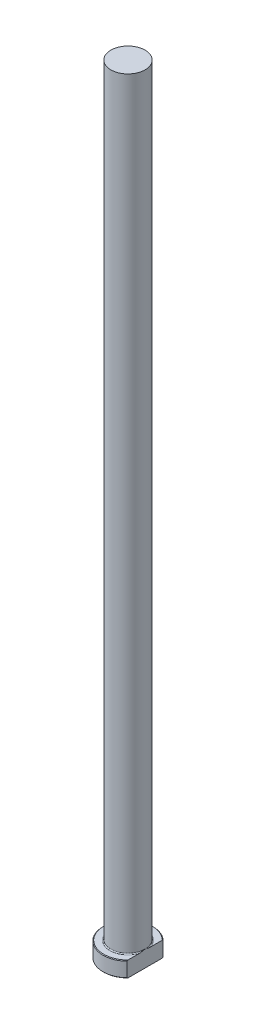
ISO-10303-21;
HEADER;
FILE_DESCRIPTION(('STEP AP214'),'2;1');
FILE_NAME('part.step','',(''),(''),'','','');
FILE_SCHEMA(('AUTOMOTIVE_DESIGN { 1 0 10303 214 1 1 1 1 }'));
ENDSEC;
DATA;
#1=APPLICATION_CONTEXT('core data for automotive mechanical design processes');
#2=APPLICATION_PROTOCOL_DEFINITION('international standard','automotive_design',2000,#1);
#3=PRODUCT_CONTEXT('',#1,'mechanical');
#4=PRODUCT('Part','Part','',(#3));
#5=PRODUCT_RELATED_PRODUCT_CATEGORY('part','',(#4));
#6=PRODUCT_DEFINITION_FORMATION('','',#4);
#7=PRODUCT_DEFINITION_CONTEXT('part definition',#1,'design');
#8=PRODUCT_DEFINITION('design','',#6,#7);
#9=PRODUCT_DEFINITION_SHAPE('','',#8);
#10=(LENGTH_UNIT() NAMED_UNIT(*) SI_UNIT(.MILLI.,.METRE.));
#11=(NAMED_UNIT(*) PLANE_ANGLE_UNIT() SI_UNIT($,.RADIAN.));
#12=(NAMED_UNIT(*) SI_UNIT($,.STERADIAN.) SOLID_ANGLE_UNIT());
#13=UNCERTAINTY_MEASURE_WITH_UNIT(LENGTH_MEASURE(1.E-05),#10,'distance_accuracy_value','');
#14=(GEOMETRIC_REPRESENTATION_CONTEXT(3) GLOBAL_UNCERTAINTY_ASSIGNED_CONTEXT((#13)) GLOBAL_UNIT_ASSIGNED_CONTEXT((#10,
#11,#12)) REPRESENTATION_CONTEXT('',''));
#15=CARTESIAN_POINT('',(0.,0.,0.));
#16=DIRECTION('',(0.,0.,1.));
#17=DIRECTION('',(1.,0.,0.));
#18=AXIS2_PLACEMENT_3D('',#15,#16,#17);
#19=CARTESIAN_POINT('',(0.,0.,0.));
#20=DIRECTION('',(0.,-1.,0.));
#21=DIRECTION('',(0.,0.,-1.));
#22=AXIS2_PLACEMENT_3D('',#19,#20,#21);
#23=PLANE('',#22);
#24=CARTESIAN_POINT('',(0.,0.,0.));
#25=DIRECTION('',(0.,-1.,0.));
#26=DIRECTION('',(0.,0.,-1.));
#27=AXIS2_PLACEMENT_3D('',#24,#25,#26);
#28=CIRCLE('',#27,7.79999999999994);
#29=CARTESIAN_POINT('',(5.49999999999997,0.,5.53082272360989));
#30=VERTEX_POINT('',#29);
#31=CARTESIAN_POINT('',(5.49999999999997,0.,-5.53082272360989));
#32=VERTEX_POINT('',#31);
#33=EDGE_CURVE('E98',#30,#32,#28,.T.);
#34=ORIENTED_EDGE('',*,*,#33,.T.);
#35=DIRECTION('',(0.,0.,1.));
#36=VECTOR('',#35,1.);
#37=CARTESIAN_POINT('',(5.49999999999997,0.,-5.80947501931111));
#38=LINE('',#37,#36);
#39=EDGE_CURVE('E83',#32,#30,#38,.T.);
#40=ORIENTED_EDGE('',*,*,#39,.T.);
#41=EDGE_LOOP('',(#34,#40));
#42=FACE_BOUND('',#41,.T.);
#43=ADVANCED_FACE('F32',(#42),#23,.T.);
#44=CARTESIAN_POINT('',(0.,259.958771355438,0.));
#45=DIRECTION('',(0.,1.,0.));
#46=DIRECTION('',(0.,0.,1.));
#47=AXIS2_PLACEMENT_3D('',#44,#45,#46);
#48=CYLINDRICAL_SURFACE('',#47,7.99999999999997);
#49=CARTESIAN_POINT('',(0.,4.80000000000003,0.));
#50=DIRECTION('',(0.,1.,0.));
#51=DIRECTION('',(0.,0.,1.));
#52=AXIS2_PLACEMENT_3D('',#49,#50,#51);
#53=CIRCLE('',#52,7.99999999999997);
#54=CARTESIAN_POINT('',(5.49999999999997,4.80000000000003,5.80947501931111));
#55=VERTEX_POINT('',#54);
#56=CARTESIAN_POINT('',(5.49999999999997,4.80000000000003,-5.80947501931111));
#57=VERTEX_POINT('',#56);
#58=EDGE_CURVE('E104',#55,#57,#53,.F.);
#59=ORIENTED_EDGE('',*,*,#58,.T.);
#60=DIRECTION('',(0.,-1.,0.));
#61=VECTOR('',#60,1.);
#62=CARTESIAN_POINT('',(5.49999999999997,250.,-5.80947501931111));
#63=LINE('',#62,#61);
#64=CARTESIAN_POINT('',(5.49999999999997,0.200000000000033,-5.80947501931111));
#65=VERTEX_POINT('',#64);
#66=EDGE_CURVE('E183',#57,#65,#63,.T.);
#67=ORIENTED_EDGE('',*,*,#66,.T.);
#68=CARTESIAN_POINT('',(0.,0.200000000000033,0.));
#69=DIRECTION('',(0.,-1.,0.));
#70=DIRECTION('',(0.,0.,-1.));
#71=AXIS2_PLACEMENT_3D('',#68,#69,#70);
#72=CIRCLE('',#71,7.99999999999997);
#73=CARTESIAN_POINT('',(5.49999999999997,0.200000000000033,5.80947501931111));
#74=VERTEX_POINT('',#73);
#75=EDGE_CURVE('E100',#65,#74,#72,.F.);
#76=ORIENTED_EDGE('',*,*,#75,.T.);
#77=DIRECTION('',(0.,-1.,0.));
#78=VECTOR('',#77,1.);
#79=CARTESIAN_POINT('',(5.49999999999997,250.,5.80947501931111));
#80=LINE('',#79,#78);
#81=EDGE_CURVE('E93',#55,#74,#80,.T.);
#82=ORIENTED_EDGE('',*,*,#81,.F.);
#83=EDGE_LOOP('',(#59,#67,#76,#82));
#84=FACE_BOUND('',#83,.T.);
#85=ADVANCED_FACE('F158',(#84),#48,.T.);
#86=CARTESIAN_POINT('',(-7.99999999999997,5.,0.));
#87=DIRECTION('',(0.,1.,0.));
#88=DIRECTION('',(0.,0.,1.));
#89=AXIS2_PLACEMENT_3D('',#86,#87,#88);
#90=PLANE('',#89);
#91=CARTESIAN_POINT('',(0.,5.,0.));
#92=DIRECTION('',(0.,1.,0.));
#93=DIRECTION('',(0.,0.,1.));
#94=AXIS2_PLACEMENT_3D('',#91,#92,#93);
#95=CIRCLE('',#94,7.79999999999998);
#96=CARTESIAN_POINT('',(5.49999999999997,5.,-5.53082272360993));
#97=VERTEX_POINT('',#96);
#98=CARTESIAN_POINT('',(5.49999999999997,5.,5.53082272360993));
#99=VERTEX_POINT('',#98);
#100=EDGE_CURVE('E178',#97,#99,#95,.T.);
#101=ORIENTED_EDGE('',*,*,#100,.T.);
#102=DIRECTION('',(0.,0.,-1.));
#103=VECTOR('',#102,1.);
#104=CARTESIAN_POINT('',(5.49999999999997,5.,0.));
#105=LINE('',#104,#103);
#106=CARTESIAN_POINT('',(5.49999999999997,4.99999999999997,1.84119526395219));
#107=VERTEX_POINT('',#106);
#108=EDGE_CURVE('E57',#99,#107,#105,.T.);
#109=ORIENTED_EDGE('',*,*,#108,.T.);
#110=CARTESIAN_POINT('',(0.,5.,0.));
#111=DIRECTION('',(0.,1.,0.));
#112=DIRECTION('',(0.,0.,1.));
#113=AXIS2_PLACEMENT_3D('',#110,#111,#112);
#114=CIRCLE('',#113,5.79999999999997);
#115=CARTESIAN_POINT('',(5.49999999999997,4.99999999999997,-1.84119526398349));
#116=VERTEX_POINT('',#115);
#117=EDGE_CURVE('E107',#107,#116,#114,.F.);
#118=ORIENTED_EDGE('',*,*,#117,.T.);
#119=EDGE_CURVE('E136',#116,#97,#105,.T.);
#120=ORIENTED_EDGE('',*,*,#119,.T.);
#121=EDGE_LOOP('',(#101,#109,#118,#120));
#122=FACE_BOUND('',#121,.T.);
#123=ADVANCED_FACE('F147',(#122),#90,.T.);
#124=CARTESIAN_POINT('',(0.,5.,0.));
#125=DIRECTION('',(0.,-1.,0.));
#126=DIRECTION('',(0.,0.,-1.));
#127=AXIS2_PLACEMENT_3D('',#124,#125,#126);
#128=CONICAL_SURFACE('',#127,7.79999999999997,0.785398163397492);
#129=ORIENTED_EDGE('',*,*,#58,.F.);
#130=CARTESIAN_POINT('',(5.49999999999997,-1.11515403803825,12.7820777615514));
#131=CARTESIAN_POINT('',(5.49999999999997,-0.94151788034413,12.5930460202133));
#132=CARTESIAN_POINT('',(5.49999999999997,-0.768204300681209,12.4037180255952));
#133=CARTESIAN_POINT('',(5.49999999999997,-0.422318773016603,12.0243831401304));
#134=CARTESIAN_POINT('',(5.49999999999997,-0.249746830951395,11.8343762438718));
#135=CARTESIAN_POINT('',(5.49999999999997,0.266785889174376,11.2631256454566));
#136=CARTESIAN_POINT('',(5.49999999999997,0.609484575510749,10.8807378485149));
#137=CARTESIAN_POINT('',(5.49999999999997,1.29256544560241,10.1095655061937));
#138=CARTESIAN_POINT('',(5.49999999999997,1.63291928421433,9.72075580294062));
#139=CARTESIAN_POINT('',(5.49999999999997,2.30738282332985,8.9378216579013));
#140=CARTESIAN_POINT('',(5.49999999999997,2.64149328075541,8.54369787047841));
#141=CARTESIAN_POINT('',(5.49999999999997,3.24251408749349,7.81851180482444));
#142=CARTESIAN_POINT('',(5.49999999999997,3.51085021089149,7.48863708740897));
#143=CARTESIAN_POINT('',(5.49999999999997,3.90712731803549,6.98880713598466));
#144=CARTESIAN_POINT('',(5.49999999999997,4.03820076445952,6.82133570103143));
#145=CARTESIAN_POINT('',(5.49999999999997,4.29784042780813,6.48446279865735));
#146=CARTESIAN_POINT('',(5.49999999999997,4.42640670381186,6.31506137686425));
#147=CARTESIAN_POINT('',(5.49999999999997,4.68038690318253,5.97419641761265));
#148=CARTESIAN_POINT('',(5.49999999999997,4.80580413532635,5.80273535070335));
#149=CARTESIAN_POINT('',(5.49999999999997,5.05297330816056,5.4571974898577));
#150=CARTESIAN_POINT('',(5.49999999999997,5.17472543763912,5.2831208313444));
#151=CARTESIAN_POINT('',(5.49999999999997,5.41367984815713,4.93196486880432));
#152=CARTESIAN_POINT('',(5.49999999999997,5.53088395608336,4.75488681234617));
#153=CARTESIAN_POINT('',(5.49999999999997,5.7596825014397,4.3971560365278));
#154=CARTESIAN_POINT('',(5.49999999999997,5.87127761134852,4.21650374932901));
#155=CARTESIAN_POINT('',(5.49999999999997,6.08629942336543,3.85292662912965));
#156=CARTESIAN_POINT('',(5.49999999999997,6.18979942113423,3.67004539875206));
#157=CARTESIAN_POINT('',(5.49999999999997,6.38808999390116,3.29955746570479));
#158=CARTESIAN_POINT('',(5.49999999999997,6.48287965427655,3.11195026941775));
#159=CARTESIAN_POINT('',(5.49999999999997,6.66127167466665,2.7316929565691));
#160=CARTESIAN_POINT('',(5.49999999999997,6.7448862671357,2.53904863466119));
#161=CARTESIAN_POINT('',(5.49999999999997,6.89808375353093,2.14822839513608));
#162=CARTESIAN_POINT('',(5.49999999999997,6.96767069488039,1.95005409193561));
#163=CARTESIAN_POINT('',(5.49999999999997,7.07670147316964,1.59030424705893));
#164=CARTESIAN_POINT('',(5.49999999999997,7.11940527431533,1.42972239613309));
#165=CARTESIAN_POINT('',(5.49999999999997,7.19217730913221,1.10570020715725));
#166=CARTESIAN_POINT('',(5.49999999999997,7.22224726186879,0.94226026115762));
#167=CARTESIAN_POINT('',(5.49999999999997,7.26823317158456,0.613832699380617));
#168=CARTESIAN_POINT('',(5.49999999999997,7.28418798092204,0.448850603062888));
#169=CARTESIAN_POINT('',(5.49999999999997,7.30121051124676,0.118111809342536));
#170=CARTESIAN_POINT('',(5.49999999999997,7.30227865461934,-0.0476448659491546));
#171=CARTESIAN_POINT('',(5.49999999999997,7.28946437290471,-0.378643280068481));
#172=CARTESIAN_POINT('',(5.49999999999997,7.27557532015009,-0.54388475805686));
#173=CARTESIAN_POINT('',(5.49999999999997,7.23360586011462,-0.872541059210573));
#174=CARTESIAN_POINT('',(5.49999999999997,7.20552424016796,-1.03595572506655));
#175=CARTESIAN_POINT('',(5.49999999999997,7.13645491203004,-1.36050703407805));
#176=CARTESIAN_POINT('',(5.49999999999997,7.09542895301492,-1.52163542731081));
#177=CARTESIAN_POINT('',(5.49999999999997,7.00220098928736,-1.84058362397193));
#178=CARTESIAN_POINT('',(5.49999999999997,6.94999898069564,-1.99840342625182));
#179=CARTESIAN_POINT('',(5.49999999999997,6.82412729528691,-2.34351289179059));
#180=CARTESIAN_POINT('',(5.49999999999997,6.74825204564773,-2.52999311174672));
#181=CARTESIAN_POINT('',(5.49999999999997,6.58537605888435,-2.89807095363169));
#182=CARTESIAN_POINT('',(5.49999999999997,6.4983700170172,-3.07966619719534));
#183=CARTESIAN_POINT('',(5.49999999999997,6.31536700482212,-3.43865575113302));
#184=CARTESIAN_POINT('',(5.49999999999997,6.21935375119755,-3.61604169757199));
#185=CARTESIAN_POINT('',(5.49999999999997,6.02029718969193,-3.96676299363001));
#186=CARTESIAN_POINT('',(5.49999999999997,5.91725492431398,-4.14009893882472));
#187=CARTESIAN_POINT('',(5.49999999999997,5.70428964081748,-4.4852832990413));
#188=CARTESIAN_POINT('',(5.49999999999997,5.59430018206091,-4.65709053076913));
#189=CARTESIAN_POINT('',(5.49999999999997,5.3696632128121,-4.99762683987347));
#190=CARTESIAN_POINT('',(5.49999999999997,5.25501557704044,-5.16635583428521));
#191=CARTESIAN_POINT('',(5.49999999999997,5.02205528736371,-5.50098485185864));
#192=CARTESIAN_POINT('',(5.49999999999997,4.90374674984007,-5.66688774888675));
#193=CARTESIAN_POINT('',(5.49999999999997,4.66400808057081,-5.9964258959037));
#194=CARTESIAN_POINT('',(5.49999999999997,4.54257783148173,-6.16006106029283));
#195=CARTESIAN_POINT('',(5.49999999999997,4.20154795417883,-6.61207712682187));
#196=CARTESIAN_POINT('',(5.49999999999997,3.97915323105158,-6.89834873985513));
#197=CARTESIAN_POINT('',(5.49999999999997,3.52835863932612,-7.46612572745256));
#198=CARTESIAN_POINT('',(5.49999999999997,3.29995838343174,-7.7476307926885));
#199=CARTESIAN_POINT('',(5.49999999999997,2.83846100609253,-8.30706072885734));
#200=CARTESIAN_POINT('',(5.49999999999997,2.6053609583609,-8.58498318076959));
#201=CARTESIAN_POINT('',(5.49999999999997,2.13563301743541,-9.13783071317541));
#202=CARTESIAN_POINT('',(5.49999999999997,1.89900507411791,-9.41275575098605));
#203=CARTESIAN_POINT('',(5.49999999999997,1.43345389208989,-9.94811769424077));
#204=CARTESIAN_POINT('',(5.49999999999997,1.2046506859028,-10.2086591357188));
#205=CARTESIAN_POINT('',(5.49999999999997,0.744976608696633,-10.7279148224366));
#206=CARTESIAN_POINT('',(5.49999999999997,0.514105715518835,-10.9866290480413));
#207=CARTESIAN_POINT('',(5.49999999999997,0.0509694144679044,-11.5022006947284));
#208=CARTESIAN_POINT('',(5.49999999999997,-0.181293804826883,-11.7590600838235));
#209=CARTESIAN_POINT('',(5.49999999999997,-0.647231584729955,-12.2714820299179));
#210=CARTESIAN_POINT('',(5.49999999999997,-0.880906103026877,-12.5270446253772));
#211=CARTESIAN_POINT('',(5.49999999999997,-1.11515403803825,-12.7820777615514));
#212=B_SPLINE_CURVE_WITH_KNOTS('',3,(#130,#131,#132,#133,#134,#135,#136,#137,#138,#139,#140,
#141,#142,#143,#144,#145,#146,#147,#148,#149,#150,#151,#152,#153,#154,#155,#156,#157,#158,#159,
#160,#161,#162,#163,#164,#165,#166,#167,#168,#169,#170,#171,#172,#173,#174,#175,#176,#177,#178,
#179,#180,#181,#182,#183,#184,#185,#186,#187,#188,#189,#190,#191,#192,#193,#194,#195,#196,#197,
#198,#199,#200,#201,#202,#203,#204,#205,#206,#207,#208,#209,#210,#211),.UNSPECIFIED.,.F.,.F.,(4,
2,2,2,2,2,2,2,2,2,2,2,2,2,2,2,2,2,2,2,2,2,2,2,2,2,2,2,2,2,2,2,2,2,2,2,2,2,2,2,4),(0.,
0.770026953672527,1.54006005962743,3.080476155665,4.63063153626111,6.18059774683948,
7.45618053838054,8.09416066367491,8.73212573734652,9.36938977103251,10.006620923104,
10.6435933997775,11.2804893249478,11.9107163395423,12.5410094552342,13.1706068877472,
13.800022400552,14.2980757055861,14.7960612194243,15.2926717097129,15.7892681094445,
16.2860846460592,16.782943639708,17.2812848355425,17.7796262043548,18.3831348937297,
18.9869322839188,19.5918430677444,20.1966643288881,20.8085675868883,21.4204873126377,
22.031742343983,22.6430203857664,23.7304168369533,24.8178835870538,25.9060497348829,
26.99423135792,28.0344561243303,29.0746920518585,30.1135832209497,31.1524433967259),.UNSPECIFIED.);
#213=EDGE_CURVE('E135',#55,#99,#212,.T.);
#214=ORIENTED_EDGE('',*,*,#213,.T.);
#215=ORIENTED_EDGE('',*,*,#100,.F.);
#216=EDGE_CURVE('E127',#97,#57,#212,.T.);
#217=ORIENTED_EDGE('',*,*,#216,.T.);
#218=EDGE_LOOP('',(#129,#214,#215,#217));
#219=FACE_BOUND('',#218,.T.);
#220=ADVANCED_FACE('F143',(#219),#128,.T.);
#221=CARTESIAN_POINT('',(0.,0.200000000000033,0.));
#222=DIRECTION('',(0.,1.,0.));
#223=DIRECTION('',(0.,0.,1.));
#224=AXIS2_PLACEMENT_3D('',#221,#222,#223);
#225=CONICAL_SURFACE('',#224,7.99999999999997,0.785398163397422);
#226=ORIENTED_EDGE('',*,*,#75,.F.);
#227=CARTESIAN_POINT('',(5.49999999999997,6.11515403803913,-12.7820777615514));
#228=CARTESIAN_POINT('',(5.49999999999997,5.941517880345,-12.5930460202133));
#229=CARTESIAN_POINT('',(5.49999999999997,5.76820430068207,-12.4037180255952));
#230=CARTESIAN_POINT('',(5.49999999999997,5.42231877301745,-12.0243831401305));
#231=CARTESIAN_POINT('',(5.49999999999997,5.24974683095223,-11.8343762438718));
#232=CARTESIAN_POINT('',(5.49999999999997,4.73321411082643,-11.2631256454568));
#233=CARTESIAN_POINT('',(5.49999999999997,4.39051542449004,-10.8807378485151));
#234=CARTESIAN_POINT('',(5.49999999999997,3.70743455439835,-10.109565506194));
#235=CARTESIAN_POINT('',(5.49999999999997,3.36708071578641,-9.7207558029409));
#236=CARTESIAN_POINT('',(5.49999999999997,2.69261717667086,-8.93782165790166));
#237=CARTESIAN_POINT('',(5.49999999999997,2.35850671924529,-8.54369787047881));
#238=CARTESIAN_POINT('',(5.49999999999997,1.75748591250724,-7.81851180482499));
#239=CARTESIAN_POINT('',(5.49999999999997,1.48914978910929,-7.48863708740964));
#240=CARTESIAN_POINT('',(5.49999999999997,1.09287268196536,-6.9888071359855));
#241=CARTESIAN_POINT('',(5.49999999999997,0.961799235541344,-6.82133570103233));
#242=CARTESIAN_POINT('',(5.49999999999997,0.702159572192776,-6.48446279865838));
#243=CARTESIAN_POINT('',(5.49999999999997,0.573593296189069,-6.31506137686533));
#244=CARTESIAN_POINT('',(5.49999999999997,0.319613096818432,-5.97419641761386));
#245=CARTESIAN_POINT('',(5.49999999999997,0.194195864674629,-5.80273535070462));
#246=CARTESIAN_POINT('',(5.49999999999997,-0.0529733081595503,-5.4571974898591));
#247=CARTESIAN_POINT('',(5.49999999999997,-0.174725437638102,-5.28312083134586));
#248=CARTESIAN_POINT('',(5.49999999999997,-0.413679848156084,-4.93196486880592));
#249=CARTESIAN_POINT('',(5.49999999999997,-0.530883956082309,-4.75488681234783));
#250=CARTESIAN_POINT('',(5.49999999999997,-0.759682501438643,-4.39715603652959));
#251=CARTESIAN_POINT('',(5.49999999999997,-0.871277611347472,-4.21650374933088));
#252=CARTESIAN_POINT('',(5.49999999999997,-1.08629942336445,-3.85292662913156));
#253=CARTESIAN_POINT('',(5.49999999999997,-1.18979942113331,-3.67004539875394));
#254=CARTESIAN_POINT('',(5.49999999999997,-1.38808999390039,-3.2995574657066));
#255=CARTESIAN_POINT('',(5.49999999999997,-1.48287965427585,-3.11195026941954));
#256=CARTESIAN_POINT('',(5.49999999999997,-1.66127167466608,-2.73169295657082));
#257=CARTESIAN_POINT('',(5.49999999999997,-1.7448862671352,-2.53904863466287));
#258=CARTESIAN_POINT('',(5.49999999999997,-1.89808375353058,-2.14822839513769));
#259=CARTESIAN_POINT('',(5.49999999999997,-1.96767069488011,-1.95005409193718));
#260=CARTESIAN_POINT('',(5.49999999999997,-2.07670147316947,-1.59030424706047));
#261=CARTESIAN_POINT('',(5.49999999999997,-2.11940527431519,-1.42972239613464));
#262=CARTESIAN_POINT('',(5.49999999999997,-2.19217730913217,-1.10570020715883));
#263=CARTESIAN_POINT('',(5.49999999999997,-2.2222472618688,-0.942260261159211));
#264=CARTESIAN_POINT('',(5.49999999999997,-2.26823317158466,-0.613832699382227));
#265=CARTESIAN_POINT('',(5.49999999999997,-2.28418798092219,-0.448850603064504));
#266=CARTESIAN_POINT('',(5.49999999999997,-2.30121051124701,-0.118111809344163));
#267=CARTESIAN_POINT('',(5.49999999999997,-2.30227865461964,0.0476448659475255));
#268=CARTESIAN_POINT('',(5.49999999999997,-2.28946437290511,0.378643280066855));
#269=CARTESIAN_POINT('',(5.49999999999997,-2.27557532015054,0.54388475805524));
#270=CARTESIAN_POINT('',(5.49999999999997,-2.23360586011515,0.872541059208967));
#271=CARTESIAN_POINT('',(5.49999999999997,-2.20552424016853,1.03595572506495));
#272=CARTESIAN_POINT('',(5.49999999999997,-2.13645491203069,1.36050703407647));
#273=CARTESIAN_POINT('',(5.49999999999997,-2.0954289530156,1.52163542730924));
#274=CARTESIAN_POINT('',(5.49999999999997,-2.0022009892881,1.84058362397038));
#275=CARTESIAN_POINT('',(5.49999999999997,-1.94999898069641,1.99840342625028));
#276=CARTESIAN_POINT('',(5.49999999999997,-1.82412729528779,2.34351289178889));
#277=CARTESIAN_POINT('',(5.49999999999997,-1.74825204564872,2.52999311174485));
#278=CARTESIAN_POINT('',(5.49999999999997,-1.58537605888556,2.8980709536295));
#279=CARTESIAN_POINT('',(5.49999999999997,-1.49837001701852,3.07966619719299));
#280=CARTESIAN_POINT('',(5.49999999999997,-1.31536700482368,3.43865575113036));
#281=CARTESIAN_POINT('',(5.49999999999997,-1.21935375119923,3.61604169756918));
#282=CARTESIAN_POINT('',(5.49999999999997,-1.02029718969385,3.9667629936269));
#283=CARTESIAN_POINT('',(5.49999999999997,-0.917254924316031,4.14009893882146));
#284=CARTESIAN_POINT('',(5.49999999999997,-0.704289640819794,4.48528329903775));
#285=CARTESIAN_POINT('',(5.49999999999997,-0.594300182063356,4.65709053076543));
#286=CARTESIAN_POINT('',(5.49999999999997,-0.369663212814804,4.99762683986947));
#287=CARTESIAN_POINT('',(5.49999999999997,-0.255015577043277,5.16635583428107));
#288=CARTESIAN_POINT('',(5.49999999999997,-0.0220552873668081,5.50098485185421));
#289=CARTESIAN_POINT('',(5.49999999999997,0.0962532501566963,5.66688774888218));
#290=CARTESIAN_POINT('',(5.49999999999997,0.335991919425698,5.99642589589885));
#291=CARTESIAN_POINT('',(5.49999999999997,0.457422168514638,6.16006106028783));
#292=CARTESIAN_POINT('',(5.49999999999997,0.798452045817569,6.61207712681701));
#293=CARTESIAN_POINT('',(5.49999999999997,1.02084676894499,6.89834873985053));
#294=CARTESIAN_POINT('',(5.49999999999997,1.47164136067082,7.46612572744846));
#295=CARTESIAN_POINT('',(5.49999999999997,1.70004161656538,7.74763079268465));
#296=CARTESIAN_POINT('',(5.49999999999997,2.16153899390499,8.30706072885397));
#297=CARTESIAN_POINT('',(5.49999999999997,2.39463904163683,8.58498318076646));
#298=CARTESIAN_POINT('',(5.49999999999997,2.86436698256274,9.13783071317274));
#299=CARTESIAN_POINT('',(5.49999999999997,3.10099492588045,9.41275575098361));
#300=CARTESIAN_POINT('',(5.49999999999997,3.56654610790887,9.94811769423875));
#301=CARTESIAN_POINT('',(5.49999999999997,3.79534931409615,10.208659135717));
#302=CARTESIAN_POINT('',(5.49999999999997,4.2550233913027,10.7279148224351));
#303=CARTESIAN_POINT('',(5.49999999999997,4.48589428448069,10.9866290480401));
#304=CARTESIAN_POINT('',(5.49999999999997,4.949030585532,11.5022006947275));
#305=CARTESIAN_POINT('',(5.49999999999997,5.18129380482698,11.7590600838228));
#306=CARTESIAN_POINT('',(5.49999999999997,5.64723158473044,12.2714820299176));
#307=CARTESIAN_POINT('',(5.49999999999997,5.88090610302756,12.527044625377));
#308=CARTESIAN_POINT('',(5.49999999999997,6.11515403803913,12.7820777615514));
#309=B_SPLINE_CURVE_WITH_KNOTS('',3,(#227,#228,#229,#230,#231,#232,#233,#234,#235,#236,#237,
#238,#239,#240,#241,#242,#243,#244,#245,#246,#247,#248,#249,#250,#251,#252,#253,#254,#255,#256,
#257,#258,#259,#260,#261,#262,#263,#264,#265,#266,#267,#268,#269,#270,#271,#272,#273,#274,#275,
#276,#277,#278,#279,#280,#281,#282,#283,#284,#285,#286,#287,#288,#289,#290,#291,#292,#293,#294,
#295,#296,#297,#298,#299,#300,#301,#302,#303,#304,#305,#306,#307,#308),.UNSPECIFIED.,.F.,.F.,(4,
2,2,2,2,2,2,2,2,2,2,2,2,2,2,2,2,2,2,2,2,2,2,2,2,2,2,2,2,2,2,2,2,2,2,2,2,2,2,2,4),(0.,
0.770026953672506,1.54006005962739,3.08047615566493,4.63063153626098,6.18059774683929,
7.45618053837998,8.09416066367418,8.7321257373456,9.36938977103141,10.0066209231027,
10.6435933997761,11.2804893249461,11.9107163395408,12.5410094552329,13.1706068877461,
13.8000224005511,14.2980757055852,14.7960612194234,15.292671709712,15.7892681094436,
16.2860846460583,16.7829436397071,17.2812848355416,17.7796262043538,18.3831348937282,
18.9869322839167,19.5918430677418,20.1966643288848,20.8085675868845,21.4204873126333,
22.031742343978,22.6430203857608,23.7304168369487,24.8178835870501,25.9060497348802,
26.9942313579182,28.0344561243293,29.0746920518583,30.1135832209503,31.1524433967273),.UNSPECIFIED.);
#310=EDGE_CURVE('E86',#65,#32,#309,.T.);
#311=ORIENTED_EDGE('',*,*,#310,.T.);
#312=ORIENTED_EDGE('',*,*,#33,.F.);
#313=EDGE_CURVE('E89',#30,#74,#309,.T.);
#314=ORIENTED_EDGE('',*,*,#313,.T.);
#315=EDGE_LOOP('',(#226,#311,#312,#314));
#316=FACE_BOUND('',#315,.T.);
#317=ADVANCED_FACE('F97',(#316),#225,.T.);
#318=CARTESIAN_POINT('',(0.,5.29999999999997,0.));
#319=DIRECTION('',(0.,1.,0.));
#320=DIRECTION('',(0.,0.,1.));
#321=AXIS2_PLACEMENT_3D('',#318,#319,#320);
#322=TOROIDAL_SURFACE('',#321,5.79999999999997,0.3);
#323=CARTESIAN_POINT('',(5.49999999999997,5.29999999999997,0.));
#324=CARTESIAN_POINT('',(5.49999999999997,5.30000062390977,1.37321730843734E-10));
#325=CARTESIAN_POINT('',(5.49999999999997,5.30000124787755,-2.69376376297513E-07));
#326=CARTESIAN_POINT('',(5.49999999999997,5.30000240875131,-9.99151691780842E-07));
#327=CARTESIAN_POINT('',(5.49999999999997,5.30000292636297,-1.47834826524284E-06));
#328=CARTESIAN_POINT('',(5.49999999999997,5.30000401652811,-2.63038637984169E-06));
#329=CARTESIAN_POINT('',(5.49999999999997,5.3000045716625,-3.32194614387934E-06));
#330=CARTESIAN_POINT('',(5.49999999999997,5.30000555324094,-4.74435536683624E-06));
#331=CARTESIAN_POINT('',(5.49999999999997,5.30000598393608,-5.47253605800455E-06));
#332=CARTESIAN_POINT('',(5.49999999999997,5.30000761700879,-8.33560288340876E-06));
#333=CARTESIAN_POINT('',(5.49999999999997,5.30000873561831,-1.05221151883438E-05));
#334=CARTESIAN_POINT('',(5.49999999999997,5.30001054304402,-1.48184286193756E-05));
#335=CARTESIAN_POINT('',(5.49999999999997,5.30001126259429,-1.69157853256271E-05));
#336=CARTESIAN_POINT('',(5.49999999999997,5.30001433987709,-2.59119235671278E-05));
#337=CARTESIAN_POINT('',(5.49999999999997,5.30001667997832,-3.28197570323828E-05));
#338=CARTESIAN_POINT('',(5.49999999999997,5.30002006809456,-4.57841698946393E-05));
#339=CARTESIAN_POINT('',(5.49999999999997,5.30002126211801,-5.18021293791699E-05));
#340=CARTESIAN_POINT('',(5.49999999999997,5.30003004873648,-9.68722229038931E-05));
#341=CARTESIAN_POINT('',(5.49999999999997,5.30003680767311,-0.000136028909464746));
#342=CARTESIAN_POINT('',(5.49999999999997,5.30006639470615,-0.000291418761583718));
#343=CARTESIAN_POINT('',(5.49999999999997,5.30009452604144,-0.000406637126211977));
#344=CARTESIAN_POINT('',(5.49999999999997,5.30020462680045,-0.000864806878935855));
#345=CARTESIAN_POINT('',(5.49999999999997,5.30028324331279,-0.00120829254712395));
#346=CARTESIAN_POINT('',(5.49999999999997,5.3005992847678,-0.00257937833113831));
#347=CARTESIAN_POINT('',(5.49999999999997,5.300840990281,-0.00360627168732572));
#348=CARTESIAN_POINT('',(5.49999999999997,5.30184970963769,-0.00790277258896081));
#349=CARTESIAN_POINT('',(5.49999999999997,5.30261131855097,-0.0111732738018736));
#350=CARTESIAN_POINT('',(5.49999999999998,5.30969442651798,-0.0415753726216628));
#351=CARTESIAN_POINT('',(5.49999999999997,5.31603915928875,-0.0687032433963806));
#352=CARTESIAN_POINT('',(5.49999999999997,5.32843561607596,-0.121865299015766));
#353=CARTESIAN_POINT('',(5.49999999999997,5.33448878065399,-0.147899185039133));
#354=CARTESIAN_POINT('',(5.49999999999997,5.34733836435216,-0.203330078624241));
#355=CARTESIAN_POINT('',(5.49999999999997,5.35413005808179,-0.232728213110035));
#356=CARTESIAN_POINT('',(5.49999999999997,5.36771480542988,-0.29186839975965));
#357=CARTESIAN_POINT('',(5.49999999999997,5.37450703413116,-0.321610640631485));
#358=CARTESIAN_POINT('',(5.49999999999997,5.3907398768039,-0.393246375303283));
#359=CARTESIAN_POINT('',(5.49999999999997,5.40013144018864,-0.435151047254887));
#360=CARTESIAN_POINT('',(5.49999999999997,5.41839331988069,-0.517899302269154));
#361=CARTESIAN_POINT('',(5.49999999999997,5.42727085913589,-0.558741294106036));
#362=CARTESIAN_POINT('',(5.49999999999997,5.45304047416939,-0.679649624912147));
#363=CARTESIAN_POINT('',(5.49999999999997,5.46946475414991,-0.759817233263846));
#364=CARTESIAN_POINT('',(5.49999999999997,5.50059525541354,-0.921248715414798));
#365=CARTESIAN_POINT('',(5.49999999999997,5.5152844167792,-1.00251591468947));
#366=CARTESIAN_POINT('',(5.49999999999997,5.54326935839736,-1.17291320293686));
#367=CARTESIAN_POINT('',(5.49999999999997,5.55631639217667,-1.2620853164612));
#368=CARTESIAN_POINT('',(5.49999999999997,5.57807460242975,-1.4407267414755));
#369=CARTESIAN_POINT('',(5.49999999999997,5.5867974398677,-1.53019459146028));
#370=CARTESIAN_POINT('',(5.49999999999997,5.59813646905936,-1.70678130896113));
#371=CARTESIAN_POINT('',(5.49999999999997,5.60093453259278,-1.79388646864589));
#372=CARTESIAN_POINT('',(5.49999999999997,5.59913730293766,-1.92371114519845));
#373=CARTESIAN_POINT('',(5.49999999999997,5.59757869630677,-1.96647130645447));
#374=CARTESIAN_POINT('',(5.49999999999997,5.59207086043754,-2.0518267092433));
#375=CARTESIAN_POINT('',(5.49999999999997,5.58812304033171,-2.09442203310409));
#376=CARTESIAN_POINT('',(5.49999999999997,5.57845042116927,-2.16952357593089));
#377=CARTESIAN_POINT('',(5.49999999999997,5.57333912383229,-2.20210765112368));
#378=CARTESIAN_POINT('',(5.49999999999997,5.56085936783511,-2.26696451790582));
#379=CARTESIAN_POINT('',(5.49999999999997,5.55348387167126,-2.29923601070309));
#380=CARTESIAN_POINT('',(5.49999999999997,5.53578949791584,-2.36314331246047));
#381=CARTESIAN_POINT('',(5.49999999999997,5.52545654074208,-2.39477528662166));
#382=CARTESIAN_POINT('',(5.49999999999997,5.50076223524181,-2.45658585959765));
#383=CARTESIAN_POINT('',(5.49999999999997,5.48639841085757,-2.48676355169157));
#384=CARTESIAN_POINT('',(5.49999999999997,5.45845930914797,-2.53258359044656));
#385=CARTESIAN_POINT('',(5.49999999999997,5.4467285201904,-2.54933279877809));
#386=CARTESIAN_POINT('',(5.49999999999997,5.42036237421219,-2.58032609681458));
#387=CARTESIAN_POINT('',(5.49999999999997,5.40575448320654,-2.59459164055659));
#388=CARTESIAN_POINT('',(5.49999999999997,5.38269146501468,-2.61139952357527));
#389=CARTESIAN_POINT('',(5.49999999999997,5.37567288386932,-2.6159011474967));
#390=CARTESIAN_POINT('',(5.49999999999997,5.36105421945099,-2.62385691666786));
#391=CARTESIAN_POINT('',(5.49999999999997,5.35345422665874,-2.62731122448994));
#392=CARTESIAN_POINT('',(5.49999999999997,5.33769516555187,-2.63292915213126));
#393=CARTESIAN_POINT('',(5.49999999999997,5.32953131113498,-2.63507966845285));
#394=CARTESIAN_POINT('',(5.49999999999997,5.31294528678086,-2.63780090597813));
#395=CARTESIAN_POINT('',(5.49999999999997,5.3045234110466,-2.63837336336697));
#396=CARTESIAN_POINT('',(5.49999999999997,5.28851094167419,-2.63789663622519));
#397=CARTESIAN_POINT('',(5.49999999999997,5.2809155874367,-2.63699270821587));
#398=CARTESIAN_POINT('',(5.49999999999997,5.26598512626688,-2.63392394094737));
#399=CARTESIAN_POINT('',(5.49999999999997,5.25865020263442,-2.6317582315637));
#400=CARTESIAN_POINT('',(5.49999999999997,5.24234078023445,-2.62556604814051));
#401=CARTESIAN_POINT('',(5.49999999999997,5.23350275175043,-2.62118324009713));
#402=CARTESIAN_POINT('',(5.49999999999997,5.21664244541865,-2.61106244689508));
#403=CARTESIAN_POINT('',(5.49999999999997,5.20862200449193,-2.60532150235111));
#404=CARTESIAN_POINT('',(5.49999999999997,5.18881724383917,-2.58912168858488));
#405=CARTESIAN_POINT('',(5.49999999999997,5.17766341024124,-2.57789934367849));
#406=CARTESIAN_POINT('',(5.49999999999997,5.15712865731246,-2.55396421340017));
#407=CARTESIAN_POINT('',(5.49999999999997,5.14775124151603,-2.54124856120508));
#408=CARTESIAN_POINT('',(5.49999999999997,5.1219531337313,-2.50201772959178));
#409=CARTESIAN_POINT('',(5.49999999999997,5.10760202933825,-2.47415772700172));
#410=CARTESIAN_POINT('',(5.49999999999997,5.08264412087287,-2.4167036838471));
#411=CARTESIAN_POINT('',(5.49999999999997,5.07206513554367,-2.38709856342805));
#412=CARTESIAN_POINT('',(5.49999999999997,5.04919805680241,-2.31224104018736));
#413=CARTESIAN_POINT('',(5.49999999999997,5.0386368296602,-2.26646729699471));
#414=CARTESIAN_POINT('',(5.49999999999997,5.02182095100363,-2.17406875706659));
#415=CARTESIAN_POINT('',(5.49999999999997,5.01557941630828,-2.12744180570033));
#416=CARTESIAN_POINT('',(5.49999999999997,5.00649716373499,-2.0351579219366));
#417=CARTESIAN_POINT('',(5.49999999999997,5.00356804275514,-1.98950936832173));
#418=CARTESIAN_POINT('',(5.49999999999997,5.00016782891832,-1.8983460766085));
#419=CARTESIAN_POINT('',(5.49999999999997,4.99968533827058,-1.85283170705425));
#420=CARTESIAN_POINT('',(5.49999999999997,5.00090888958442,-1.74240379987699));
#421=CARTESIAN_POINT('',(5.49999999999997,5.00363706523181,-1.67750284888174));
#422=CARTESIAN_POINT('',(5.49999999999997,5.01218141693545,-1.54793822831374));
#423=CARTESIAN_POINT('',(5.49999999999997,5.01799679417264,-1.48327450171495));
#424=CARTESIAN_POINT('',(5.49999999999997,5.03222723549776,-1.35268561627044));
#425=CARTESIAN_POINT('',(5.49999999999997,5.0407007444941,-1.28676695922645));
#426=CARTESIAN_POINT('',(5.49999999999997,5.05968062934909,-1.1550540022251));
#427=CARTESIAN_POINT('',(5.49999999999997,5.07019222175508,-1.08926046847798));
#428=CARTESIAN_POINT('',(5.49999999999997,5.09695256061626,-0.933785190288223));
#429=CARTESIAN_POINT('',(5.49999999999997,5.11388903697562,-0.844222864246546));
#430=CARTESIAN_POINT('',(5.49999999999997,5.14958548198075,-0.666532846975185));
#431=CARTESIAN_POINT('',(5.49999999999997,5.1683224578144,-0.578400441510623));
#432=CARTESIAN_POINT('',(5.49999999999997,5.20478806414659,-0.412629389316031));
#433=CARTESIAN_POINT('',(5.49999999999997,5.22238111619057,-0.334960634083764));
#434=CARTESIAN_POINT('',(5.49999999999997,5.24959866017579,-0.216510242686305));
#435=CARTESIAN_POINT('',(5.49999999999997,5.25904905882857,-0.175687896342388));
#436=CARTESIAN_POINT('',(5.49999999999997,5.27788780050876,-0.0947269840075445));
#437=CARTESIAN_POINT('',(5.49999999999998,5.28727465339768,-0.0545880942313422));
#438=CARTESIAN_POINT('',(5.49999999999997,5.29739035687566,-0.0111657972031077));
#439=CARTESIAN_POINT('',(5.49999999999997,5.29815375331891,-0.00788783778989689));
#440=CARTESIAN_POINT('',(5.49999999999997,5.29916288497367,-0.00358966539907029));
#441=CARTESIAN_POINT('',(5.49999999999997,5.29940322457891,-0.00256856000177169));
#442=CARTESIAN_POINT('',(5.49999999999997,5.2997176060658,-0.00120467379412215));
#443=CARTESIAN_POINT('',(5.49999999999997,5.29979589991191,-0.000862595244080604));
#444=CARTESIAN_POINT('',(5.49999999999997,5.29990561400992,-0.000406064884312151));
#445=CARTESIAN_POINT('',(5.49999999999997,5.2999336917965,-0.000291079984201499));
#446=CARTESIAN_POINT('',(5.49999999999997,5.29996322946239,-0.000135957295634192));
#447=CARTESIAN_POINT('',(5.49999999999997,5.29996998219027,-9.68324215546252E-05));
#448=CARTESIAN_POINT('',(5.49999999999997,5.29997875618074,-5.17949381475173E-05));
#449=CARTESIAN_POINT('',(5.49999999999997,5.29997994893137,-4.57786558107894E-05));
#450=CARTESIAN_POINT('',(5.49999999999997,5.29998333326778,-3.28177654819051E-05));
#451=CARTESIAN_POINT('',(5.49999999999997,5.2999856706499,-2.59116891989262E-05));
#452=CARTESIAN_POINT('',(5.49999999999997,5.29998874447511,-1.69173980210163E-05));
#453=CARTESIAN_POINT('',(5.49999999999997,5.29998946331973,-1.4820166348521E-05));
#454=CARTESIAN_POINT('',(5.49999999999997,5.29999126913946,-1.05239951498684E-05));
#455=CARTESIAN_POINT('',(5.49999999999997,5.29999238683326,-8.33748307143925E-06));
#456=CARTESIAN_POINT('',(5.49999999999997,5.29999401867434,-5.47429219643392E-06));
#457=CARTESIAN_POINT('',(5.49999999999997,5.29999444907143,-4.74604003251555E-06));
#458=CARTESIAN_POINT('',(5.49999999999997,5.29999543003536,-3.32343406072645E-06));
#459=CARTESIAN_POINT('',(5.49999999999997,5.29999598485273,-2.63174656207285E-06));
#460=CARTESIAN_POINT('',(5.49999999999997,5.29999707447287,-1.47941235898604E-06));
#461=CARTESIAN_POINT('',(5.49999999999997,5.29999759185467,-1.00005962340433E-06));
#462=CARTESIAN_POINT('',(5.49999999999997,5.29999875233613,-2.69883386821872E-07));
#463=CARTESIAN_POINT('',(5.49999999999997,5.29999937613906,-1.37310971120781E-10));
#464=CARTESIAN_POINT('',(5.49999999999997,5.29999999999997,0.));
#465=B_SPLINE_CURVE_WITH_KNOTS('',3,(#323,#324,#325,#326,#327,#328,#329,#330,#331,#332,#333,
#334,#335,#336,#337,#338,#339,#340,#341,#342,#343,#344,#345,#346,#347,#348,#349,#350,#351,#352,
#353,#354,#355,#356,#357,#358,#359,#360,#361,#362,#363,#364,#365,#366,#367,#368,#369,#370,#371,
#372,#373,#374,#375,#376,#377,#378,#379,#380,#381,#382,#383,#384,#385,#386,#387,#388,#389,#390,
#391,#392,#393,#394,#395,#396,#397,#398,#399,#400,#401,#402,#403,#404,#405,#406,#407,#408,#409,
#410,#411,#412,#413,#414,#415,#416,#417,#418,#419,#420,#421,#422,#423,#424,#425,#426,#427,#428,
#429,#430,#431,#432,#433,#434,#435,#436,#437,#438,#439,#440,#441,#442,#443,#444,#445,#446,#447,
#448,#449,#450,#451,#452,#453,#454,#455,#456,#457,#458,#459,#460,#461,#462,#463,#464),
.UNSPECIFIED.,.T.,.F.,(4,2,2,2,2,2,2,2,2,2,2,2,2,2,2,2,2,2,2,2,2,2,2,2,2,2,2,2,2,2,2,2,2,2,2,2,
2,2,2,2,2,2,2,2,2,2,2,2,2,2,2,2,2,2,2,2,2,2,2,2,2,2,2,2,2,2,2,2,2,2,4),(0.,1.89759089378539E-06,
4.0217832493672E-06,6.66436842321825E-06,9.20151056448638E-06,1.65449719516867E-05,
2.31908325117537E-05,4.50383514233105E-05,6.34229836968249E-05,0.000182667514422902,
0.000538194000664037,0.00159559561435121,0.00476009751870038,0.0148345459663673,
0.0984122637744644,0.178597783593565,0.269114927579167,0.360638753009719,0.489470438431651,
0.61485697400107,0.860339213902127,1.10806331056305,1.37834904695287,1.64790189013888,
1.90905265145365,2.03736998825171,2.16561171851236,2.26450233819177,2.36370349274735,
2.46338500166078,2.56312787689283,2.62428570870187,2.68488576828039,2.7098322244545,
2.73477480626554,2.75996408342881,2.78512563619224,2.80795720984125,2.8308045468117,
2.86023439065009,2.88972896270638,2.93692759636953,2.98421836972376,3.07771161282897,
3.17188074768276,3.31245630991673,3.45345688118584,3.59059834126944,3.7271003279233,
3.92187072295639,4.11659074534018,4.31593390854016,4.51579419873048,4.78920516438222,
5.05949875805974,5.29840417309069,5.42411083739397,5.54777320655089,5.55787065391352,
5.56101731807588,5.56207038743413,5.56242519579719,5.56254434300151,5.56256272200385,
5.56258456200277,5.56259120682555,5.56259854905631,5.56260108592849,5.56260372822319,
5.56260585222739,5.5626077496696),.UNSPECIFIED.);
#466=CARTESIAN_POINT('',(5.49999999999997,5.29999999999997,0.));
#467=VERTEX_POINT('',#466);
#468=EDGE_CURVE('E11',#116,#467,#465,.T.);
#469=ORIENTED_EDGE('',*,*,#468,.F.);
#470=ORIENTED_EDGE('',*,*,#117,.F.);
#471=CARTESIAN_POINT('',(5.49999999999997,5.29999999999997,0.));
#472=CARTESIAN_POINT('',(5.49999999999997,5.29999937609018,-1.37321567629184E-10));
#473=CARTESIAN_POINT('',(5.49999999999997,5.29999875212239,2.69376376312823E-07));
#474=CARTESIAN_POINT('',(5.49999999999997,5.29999759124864,9.9915169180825E-07));
#475=CARTESIAN_POINT('',(5.49999999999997,5.29999707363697,1.47834826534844E-06));
#476=CARTESIAN_POINT('',(5.49999999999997,5.29999598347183,2.6303863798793E-06));
#477=CARTESIAN_POINT('',(5.49999999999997,5.29999542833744,3.32194614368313E-06));
#478=CARTESIAN_POINT('',(5.49999999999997,5.299994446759,4.74435536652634E-06));
#479=CARTESIAN_POINT('',(5.49999999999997,5.29999401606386,5.47253605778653E-06));
#480=CARTESIAN_POINT('',(5.49999999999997,5.29999238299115,8.33560288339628E-06));
#481=CARTESIAN_POINT('',(5.49999999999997,5.29999126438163,1.05221151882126E-05));
#482=CARTESIAN_POINT('',(5.49999999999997,5.29998945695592,1.48184286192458E-05));
#483=CARTESIAN_POINT('',(5.49999999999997,5.29998873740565,1.69157853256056E-05));
#484=CARTESIAN_POINT('',(5.49999999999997,5.29998566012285,2.59119235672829E-05));
#485=CARTESIAN_POINT('',(5.49999999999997,5.29998332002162,3.28197570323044E-05));
#486=CARTESIAN_POINT('',(5.49999999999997,5.29997993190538,4.57841698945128E-05));
#487=CARTESIAN_POINT('',(5.49999999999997,5.29997873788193,5.18021293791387E-05));
#488=CARTESIAN_POINT('',(5.49999999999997,5.29996995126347,9.68722229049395E-05));
#489=CARTESIAN_POINT('',(5.49999999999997,5.29996319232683,0.000136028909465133));
#490=CARTESIAN_POINT('',(5.49999999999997,5.29993360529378,0.000291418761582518));
#491=CARTESIAN_POINT('',(5.49999999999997,5.2999054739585,0.000406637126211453));
#492=CARTESIAN_POINT('',(5.49999999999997,5.2997953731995,0.000864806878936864));
#493=CARTESIAN_POINT('',(5.49999999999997,5.29971675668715,0.00120829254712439));
#494=CARTESIAN_POINT('',(5.49999999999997,5.29940071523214,0.00257937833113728));
#495=CARTESIAN_POINT('',(5.49999999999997,5.29915900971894,0.00360627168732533));
#496=CARTESIAN_POINT('',(5.49999999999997,5.29815029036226,0.00790277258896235));
#497=CARTESIAN_POINT('',(5.49999999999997,5.29738868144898,0.0111732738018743));
#498=CARTESIAN_POINT('',(5.49999999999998,5.29030557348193,0.0415753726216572));
#499=CARTESIAN_POINT('',(5.49999999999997,5.28396084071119,0.0687032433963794));
#500=CARTESIAN_POINT('',(5.49999999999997,5.27156438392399,0.121865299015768));
#501=CARTESIAN_POINT('',(5.49999999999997,5.26551121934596,0.147899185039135));
#502=CARTESIAN_POINT('',(5.49999999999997,5.25266163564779,0.203330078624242));
#503=CARTESIAN_POINT('',(5.49999999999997,5.24586994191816,0.232728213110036));
#504=CARTESIAN_POINT('',(5.49999999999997,5.23228519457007,0.291868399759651));
#505=CARTESIAN_POINT('',(5.49999999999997,5.22549296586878,0.321610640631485));
#506=CARTESIAN_POINT('',(5.49999999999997,5.20926012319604,0.393246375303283));
#507=CARTESIAN_POINT('',(5.49999999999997,5.1998685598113,0.435151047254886));
#508=CARTESIAN_POINT('',(5.49999999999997,5.18160668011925,0.517899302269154));
#509=CARTESIAN_POINT('',(5.49999999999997,5.17272914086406,0.558741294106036));
#510=CARTESIAN_POINT('',(5.49999999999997,5.14695952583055,0.679649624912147));
#511=CARTESIAN_POINT('',(5.49999999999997,5.13053524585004,0.759817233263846));
#512=CARTESIAN_POINT('',(5.49999999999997,5.09940474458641,0.921248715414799));
#513=CARTESIAN_POINT('',(5.49999999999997,5.08471558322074,1.00251591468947));
#514=CARTESIAN_POINT('',(5.49999999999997,5.05673064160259,1.17291320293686));
#515=CARTESIAN_POINT('',(5.49999999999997,5.04368360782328,1.2620853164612));
#516=CARTESIAN_POINT('',(5.49999999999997,5.0219253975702,1.4407267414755));
#517=CARTESIAN_POINT('',(5.49999999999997,5.01320256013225,1.53019459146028));
#518=CARTESIAN_POINT('',(5.49999999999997,5.00186353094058,1.70678130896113));
#519=CARTESIAN_POINT('',(5.49999999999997,4.99906546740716,1.79388646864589));
#520=CARTESIAN_POINT('',(5.49999999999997,5.00086269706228,1.92371114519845));
#521=CARTESIAN_POINT('',(5.49999999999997,5.00242130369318,1.96647130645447));
#522=CARTESIAN_POINT('',(5.49999999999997,5.00792913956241,2.0518267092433));
#523=CARTESIAN_POINT('',(5.49999999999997,5.01187695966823,2.09442203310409));
#524=CARTESIAN_POINT('',(5.49999999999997,5.02154957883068,2.16952357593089));
#525=CARTESIAN_POINT('',(5.49999999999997,5.02666087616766,2.20210765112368));
#526=CARTESIAN_POINT('',(5.49999999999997,5.03914063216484,2.26696451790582));
#527=CARTESIAN_POINT('',(5.49999999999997,5.04651612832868,2.29923601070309));
#528=CARTESIAN_POINT('',(5.49999999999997,5.0642105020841,2.36314331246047));
#529=CARTESIAN_POINT('',(5.49999999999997,5.07454345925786,2.39477528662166));
#530=CARTESIAN_POINT('',(5.49999999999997,5.09923776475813,2.45658585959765));
#531=CARTESIAN_POINT('',(5.49999999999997,5.11360158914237,2.48676355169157));
#532=CARTESIAN_POINT('',(5.49999999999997,5.14154069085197,2.53258359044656));
#533=CARTESIAN_POINT('',(5.49999999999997,5.15327147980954,2.54933279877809));
#534=CARTESIAN_POINT('',(5.49999999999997,5.17963762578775,2.58032609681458));
#535=CARTESIAN_POINT('',(5.49999999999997,5.1942455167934,2.59459164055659));
#536=CARTESIAN_POINT('',(5.49999999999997,5.21730853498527,2.61139952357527));
#537=CARTESIAN_POINT('',(5.49999999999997,5.22432711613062,2.6159011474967));
#538=CARTESIAN_POINT('',(5.49999999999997,5.23894578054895,2.62385691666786));
#539=CARTESIAN_POINT('',(5.49999999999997,5.2465457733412,2.62731122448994));
#540=CARTESIAN_POINT('',(5.49999999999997,5.26230483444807,2.63292915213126));
#541=CARTESIAN_POINT('',(5.49999999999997,5.27046868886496,2.63507966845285));
#542=CARTESIAN_POINT('',(5.49999999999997,5.28705471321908,2.63780090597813));
#543=CARTESIAN_POINT('',(5.49999999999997,5.29547658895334,2.63837336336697));
#544=CARTESIAN_POINT('',(5.49999999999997,5.31148905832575,2.63789663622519));
#545=CARTESIAN_POINT('',(5.49999999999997,5.31908441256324,2.63699270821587));
#546=CARTESIAN_POINT('',(5.49999999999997,5.33401487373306,2.63392394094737));
#547=CARTESIAN_POINT('',(5.49999999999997,5.34134979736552,2.6317582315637));
#548=CARTESIAN_POINT('',(5.49999999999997,5.35765921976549,2.62556604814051));
#549=CARTESIAN_POINT('',(5.49999999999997,5.36649724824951,2.62118324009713));
#550=CARTESIAN_POINT('',(5.49999999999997,5.38335755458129,2.61106244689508));
#551=CARTESIAN_POINT('',(5.49999999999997,5.39137799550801,2.60532150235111));
#552=CARTESIAN_POINT('',(5.49999999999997,5.41118275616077,2.58912168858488));
#553=CARTESIAN_POINT('',(5.49999999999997,5.4223365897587,2.57789934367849));
#554=CARTESIAN_POINT('',(5.49999999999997,5.44287134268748,2.55396421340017));
#555=CARTESIAN_POINT('',(5.49999999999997,5.45224875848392,2.54124856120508));
#556=CARTESIAN_POINT('',(5.49999999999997,5.47804686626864,2.50201772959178));
#557=CARTESIAN_POINT('',(5.49999999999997,5.4923979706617,2.47415772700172));
#558=CARTESIAN_POINT('',(5.49999999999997,5.51735587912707,2.4167036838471));
#559=CARTESIAN_POINT('',(5.49999999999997,5.52793486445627,2.38709856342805));
#560=CARTESIAN_POINT('',(5.49999999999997,5.55080194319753,2.31224104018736));
#561=CARTESIAN_POINT('',(5.49999999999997,5.56136317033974,2.26646729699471));
#562=CARTESIAN_POINT('',(5.49999999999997,5.57817904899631,2.17406875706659));
#563=CARTESIAN_POINT('',(5.49999999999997,5.58442058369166,2.12744180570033));
#564=CARTESIAN_POINT('',(5.49999999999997,5.59350283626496,2.0351579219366));
#565=CARTESIAN_POINT('',(5.49999999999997,5.59643195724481,1.98950936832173));
#566=CARTESIAN_POINT('',(5.49999999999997,5.59983217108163,1.8983460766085));
#567=CARTESIAN_POINT('',(5.49999999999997,5.60031466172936,1.85283170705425));
#568=CARTESIAN_POINT('',(5.49999999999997,5.59909111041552,1.74240379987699));
#569=CARTESIAN_POINT('',(5.49999999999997,5.59636293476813,1.67750284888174));
#570=CARTESIAN_POINT('',(5.49999999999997,5.5878185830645,1.54793822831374));
#571=CARTESIAN_POINT('',(5.49999999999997,5.5820032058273,1.48327450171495));
#572=CARTESIAN_POINT('',(5.49999999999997,5.56777276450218,1.35268561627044));
#573=CARTESIAN_POINT('',(5.49999999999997,5.55929925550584,1.28676695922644));
#574=CARTESIAN_POINT('',(5.49999999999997,5.54031937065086,1.1550540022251));
#575=CARTESIAN_POINT('',(5.49999999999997,5.52980777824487,1.08926046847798));
#576=CARTESIAN_POINT('',(5.49999999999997,5.50304743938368,0.933785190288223));
#577=CARTESIAN_POINT('',(5.49999999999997,5.48611096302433,0.844222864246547));
#578=CARTESIAN_POINT('',(5.49999999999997,5.45041451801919,0.666532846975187));
#579=CARTESIAN_POINT('',(5.49999999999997,5.43167754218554,0.578400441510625));
#580=CARTESIAN_POINT('',(5.49999999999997,5.39521193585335,0.412629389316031));
#581=CARTESIAN_POINT('',(5.49999999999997,5.37761888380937,0.334960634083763));
#582=CARTESIAN_POINT('',(5.49999999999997,5.35040133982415,0.216510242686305));
#583=CARTESIAN_POINT('',(5.49999999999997,5.34095094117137,0.17568789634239));
#584=CARTESIAN_POINT('',(5.49999999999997,5.32211219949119,0.0947269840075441));
#585=CARTESIAN_POINT('',(5.49999999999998,5.31272534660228,0.0545880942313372));
#586=CARTESIAN_POINT('',(5.49999999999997,5.30260964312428,0.0111657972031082));
#587=CARTESIAN_POINT('',(5.49999999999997,5.30184624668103,0.00788783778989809));
#588=CARTESIAN_POINT('',(5.49999999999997,5.30083711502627,0.00358966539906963));
#589=CARTESIAN_POINT('',(5.49999999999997,5.30059677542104,0.00256856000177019));
#590=CARTESIAN_POINT('',(5.49999999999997,5.30028239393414,0.0012046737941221));
#591=CARTESIAN_POINT('',(5.49999999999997,5.30020410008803,0.000862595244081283));
#592=CARTESIAN_POINT('',(5.49999999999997,5.30009438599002,0.00040606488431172));
#593=CARTESIAN_POINT('',(5.49999999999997,5.30006630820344,0.00029107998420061));
#594=CARTESIAN_POINT('',(5.49999999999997,5.30003677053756,0.000135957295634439));
#595=CARTESIAN_POINT('',(5.49999999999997,5.30003001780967,9.68324215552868E-05));
#596=CARTESIAN_POINT('',(5.49999999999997,5.3000212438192,5.17949381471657E-05));
#597=CARTESIAN_POINT('',(5.49999999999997,5.30002005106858,4.57786558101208E-05));
#598=CARTESIAN_POINT('',(5.49999999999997,5.30001666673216,3.28177654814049E-05));
#599=CARTESIAN_POINT('',(5.49999999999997,5.30001432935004,2.59116891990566E-05));
#600=CARTESIAN_POINT('',(5.49999999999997,5.30001125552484,1.69173980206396E-05));
#601=CARTESIAN_POINT('',(5.49999999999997,5.30001053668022,1.48201663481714E-05));
#602=CARTESIAN_POINT('',(5.49999999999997,5.30000873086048,1.05239951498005E-05));
#603=CARTESIAN_POINT('',(5.49999999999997,5.30000761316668,8.33748307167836E-06));
#604=CARTESIAN_POINT('',(5.49999999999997,5.3000059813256,5.47429219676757E-06));
#605=CARTESIAN_POINT('',(5.49999999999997,5.30000555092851,4.74604003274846E-06));
#606=CARTESIAN_POINT('',(5.49999999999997,5.30000456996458,3.32343406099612E-06));
#607=CARTESIAN_POINT('',(5.49999999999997,5.30000401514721,2.63174656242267E-06));
#608=CARTESIAN_POINT('',(5.49999999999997,5.30000292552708,1.47941235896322E-06));
#609=CARTESIAN_POINT('',(5.49999999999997,5.30000240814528,1.00005962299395E-06));
#610=CARTESIAN_POINT('',(5.49999999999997,5.30000124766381,2.69883386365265E-07));
#611=CARTESIAN_POINT('',(5.49999999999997,5.30000062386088,1.37310807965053E-10));
#612=CARTESIAN_POINT('',(5.49999999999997,5.29999999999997,0.));
#613=B_SPLINE_CURVE_WITH_KNOTS('',3,(#471,#472,#473,#474,#475,#476,#477,#478,#479,#480,#481,
#482,#483,#484,#485,#486,#487,#488,#489,#490,#491,#492,#493,#494,#495,#496,#497,#498,#499,#500,
#501,#502,#503,#504,#505,#506,#507,#508,#509,#510,#511,#512,#513,#514,#515,#516,#517,#518,#519,
#520,#521,#522,#523,#524,#525,#526,#527,#528,#529,#530,#531,#532,#533,#534,#535,#536,#537,#538,
#539,#540,#541,#542,#543,#544,#545,#546,#547,#548,#549,#550,#551,#552,#553,#554,#555,#556,#557,
#558,#559,#560,#561,#562,#563,#564,#565,#566,#567,#568,#569,#570,#571,#572,#573,#574,#575,#576,
#577,#578,#579,#580,#581,#582,#583,#584,#585,#586,#587,#588,#589,#590,#591,#592,#593,#594,#595,
#596,#597,#598,#599,#600,#601,#602,#603,#604,#605,#606,#607,#608,#609,#610,#611,#612),
.UNSPECIFIED.,.T.,.F.,(4,2,2,2,2,2,2,2,2,2,2,2,2,2,2,2,2,2,2,2,2,2,2,2,2,2,2,2,2,2,2,2,2,2,2,2,
2,2,2,2,2,2,2,2,2,2,2,2,2,2,2,2,2,2,2,2,2,2,2,2,2,2,2,2,2,2,2,2,2,2,4),(0.,1.89759089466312E-06,
4.02178324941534E-06,6.66436842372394E-06,9.20151056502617E-06,1.65449719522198E-05,
2.31908325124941E-05,4.50383514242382E-05,6.3422983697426E-05,0.000182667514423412,
0.000538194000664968,0.00159559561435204,0.00476009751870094,0.0148345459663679,
0.0984122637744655,0.178597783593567,0.269114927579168,0.36063875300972,0.489470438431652,
0.61485697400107,0.860339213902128,1.10806331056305,1.37834904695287,1.64790189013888,
1.90905265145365,2.03736998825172,2.16561171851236,2.26450233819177,2.36370349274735,
2.46338500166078,2.56312787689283,2.62428570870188,2.68488576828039,2.7098322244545,
2.73477480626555,2.75996408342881,2.78512563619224,2.80795720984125,2.8308045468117,
2.86023439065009,2.88972896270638,2.93692759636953,2.98421836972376,3.07771161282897,
3.17188074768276,3.31245630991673,3.45345688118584,3.59059834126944,3.7271003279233,
3.92187072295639,4.11659074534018,4.31593390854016,4.51579419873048,4.78920516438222,
5.05949875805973,5.29840417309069,5.42411083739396,5.54777320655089,5.55787065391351,
5.56101731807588,5.56207038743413,5.56242519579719,5.56254434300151,5.56256272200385,
5.56258456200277,5.56259120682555,5.56259854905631,5.56260108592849,5.56260372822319,
5.56260585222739,5.5626077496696),.UNSPECIFIED.);
#614=EDGE_CURVE('E46',#467,#107,#613,.T.);
#615=ORIENTED_EDGE('',*,*,#614,.F.);
#616=CARTESIAN_POINT('',(0.,5.29999999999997,0.));
#617=DIRECTION('',(0.,1.,0.));
#618=DIRECTION('',(0.,0.,1.));
#619=AXIS2_PLACEMENT_3D('',#616,#617,#618);
#620=CIRCLE('',#619,5.49999999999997);
#621=EDGE_CURVE('E103',#467,#467,#620,.T.);
#622=ORIENTED_EDGE('',*,*,#621,.F.);
#623=EDGE_LOOP('',(#469,#470,#615,#622));
#624=FACE_BOUND('',#623,.T.);
#625=ADVANCED_FACE('F34',(#624),#322,.F.);
#626=CARTESIAN_POINT('',(0.,259.958771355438,0.));
#627=DIRECTION('',(0.,1.,0.));
#628=DIRECTION('',(0.,0.,1.));
#629=AXIS2_PLACEMENT_3D('',#626,#627,#628);
#630=CYLINDRICAL_SURFACE('',#629,5.49999999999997);
#631=ORIENTED_EDGE('',*,*,#621,.T.);
#632=EDGE_LOOP('',(#631));
#633=FACE_BOUND('',#632,.T.);
#634=CARTESIAN_POINT('',(0.,250.,0.));
#635=DIRECTION('',(0.,1.,0.));
#636=DIRECTION('',(0.,0.,1.));
#637=AXIS2_PLACEMENT_3D('',#634,#635,#636);
#638=CIRCLE('',#637,5.49999999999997);
#639=CARTESIAN_POINT('',(0.,250.,5.49999999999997));
#640=VERTEX_POINT('',#639);
#641=EDGE_CURVE('E101',#640,#640,#638,.T.);
#642=ORIENTED_EDGE('',*,*,#641,.F.);
#643=EDGE_LOOP('',(#642));
#644=FACE_BOUND('',#643,.T.);
#645=ADVANCED_FACE('F155',(#633,#644),#630,.T.);
#646=CARTESIAN_POINT('',(-5.49999999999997,250.,0.));
#647=DIRECTION('',(0.,1.,0.));
#648=DIRECTION('',(0.,0.,1.));
#649=AXIS2_PLACEMENT_3D('',#646,#647,#648);
#650=PLANE('',#649);
#651=ORIENTED_EDGE('',*,*,#641,.T.);
#652=EDGE_LOOP('',(#651));
#653=FACE_BOUND('',#652,.T.);
#654=ADVANCED_FACE('F121',(#653),#650,.T.);
#655=CARTESIAN_POINT('',(5.49999999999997,250.,-5.80947501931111));
#656=DIRECTION('',(1.,0.,0.));
#657=DIRECTION('',(0.,0.,-1.));
#658=AXIS2_PLACEMENT_3D('',#655,#656,#657);
#659=PLANE('',#658);
#660=ORIENTED_EDGE('',*,*,#66,.F.);
#661=ORIENTED_EDGE('',*,*,#216,.F.);
#662=ORIENTED_EDGE('',*,*,#119,.F.);
#663=ORIENTED_EDGE('',*,*,#468,.T.);
#664=ORIENTED_EDGE('',*,*,#614,.T.);
#665=ORIENTED_EDGE('',*,*,#108,.F.);
#666=ORIENTED_EDGE('',*,*,#213,.F.);
#667=ORIENTED_EDGE('',*,*,#81,.T.);
#668=ORIENTED_EDGE('',*,*,#313,.F.);
#669=ORIENTED_EDGE('',*,*,#39,.F.);
#670=ORIENTED_EDGE('',*,*,#310,.F.);
#671=EDGE_LOOP('',(#660,#661,#662,#663,#664,#665,#666,#667,#668,#669,#670));
#672=FACE_BOUND('',#671,.T.);
#673=ADVANCED_FACE('F85',(#672),#659,.T.);
#674=CLOSED_SHELL('',(#43,#85,#123,#220,#317,#625,#645,#654,#673));
#675=MANIFOLD_SOLID_BREP('B2',#674);
#676=ADVANCED_BREP_SHAPE_REPRESENTATION('',(#18,#675),#14);
#677=SHAPE_DEFINITION_REPRESENTATION(#9,#676);
ENDSEC;
END-ISO-10303-21;
